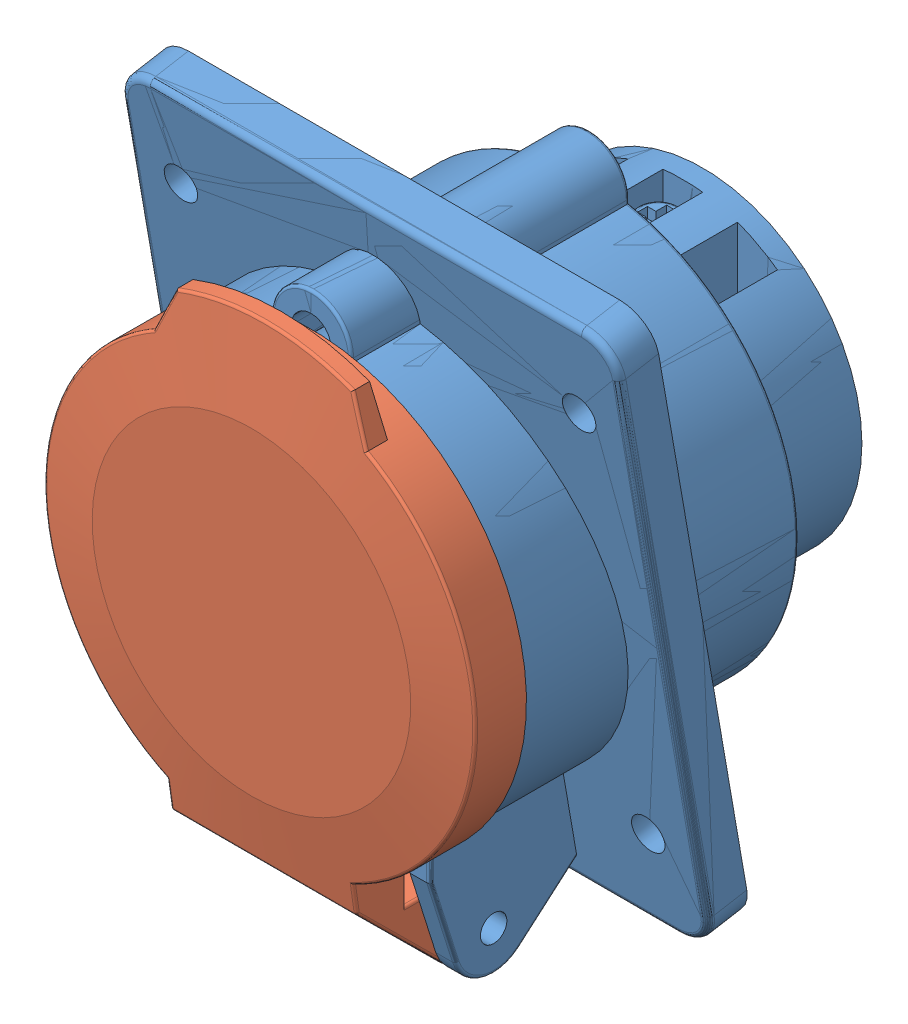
SolidWorks assembly Сборка 413-16.SLDASM, configuration По умолчанию (file format 10000). Lengths in mm.
Overall size (75 93.5 68).
2 component instances, 2 part files, 3 mates.
Components (placement in the parent):
- Корпус 413-1: Корпус 413.SLDPRT [По умолчанию] at (77.1154 47.8014 25.7673) size (75 93.5 59.02)
- Крышка 415, 414, 413-1: Крышка 415, 414, 413.SLDPRT [По умолчанию] at (77.1154 47.8014 76.7673) x (0 -1 0) z (0 0 -1) size (85 64.9 25)
Mates (geometry in assembly coordinates):
- Концентричный1: concentric anti-aligned: cylinder of Корпус 413-1 through (77.1154 47.8014 67.7673) axis (0 0 -1) radius 31.5; cylinder of Крышка 415, 414, 413-1 through (77.1154 47.8014 53.7673) axis (0 0 1) radius 32.4495
- Параллельность1: parallel anti-aligned: plane of Корпус 413-1 through (62.6154 -3.3303 50.2673) normal (1 0 0); plane of Крышка 415, 414, 413-1 through (63.1154 5.8014 57.7673) normal (-1 0 0)
- Совпадение1: coincident anti-aligned: plane of Корпус 413-1 through (77.1154 47.8014 67.7673) normal (0 0 1); plane of Крышка 415, 414, 413-1 through (77.1154 47.8014 67.7673) normal (0 0 -1)
